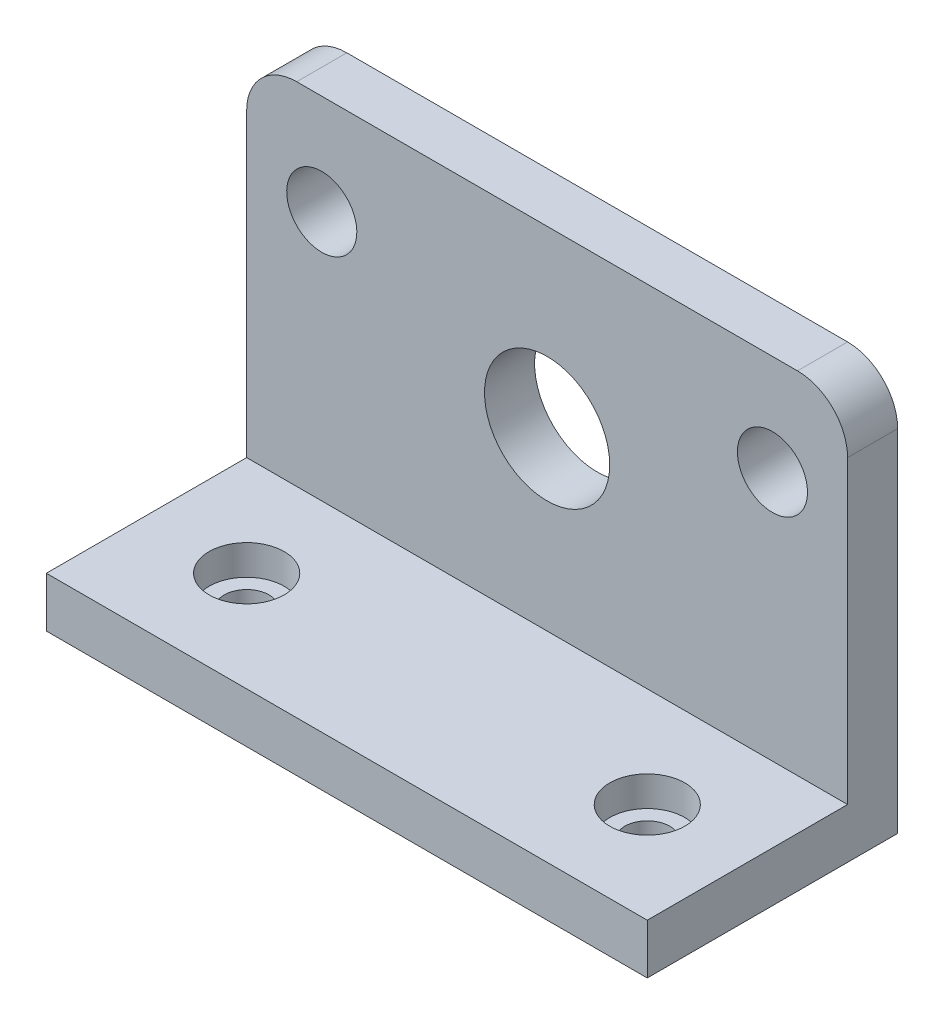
ISO-10303-21;
HEADER;
FILE_DESCRIPTION(('STEP AP214'),'2;1');
FILE_NAME('part.step','',(''),(''),'','','');
FILE_SCHEMA(('AUTOMOTIVE_DESIGN { 1 0 10303 214 1 1 1 1 }'));
ENDSEC;
DATA;
#1=APPLICATION_CONTEXT('core data for automotive mechanical design processes');
#2=APPLICATION_PROTOCOL_DEFINITION('international standard','automotive_design',2000,#1);
#3=PRODUCT_CONTEXT('',#1,'mechanical');
#4=PRODUCT('Part','Part','',(#3));
#5=PRODUCT_RELATED_PRODUCT_CATEGORY('part','',(#4));
#6=PRODUCT_DEFINITION_FORMATION('','',#4);
#7=PRODUCT_DEFINITION_CONTEXT('part definition',#1,'design');
#8=PRODUCT_DEFINITION('design','',#6,#7);
#9=PRODUCT_DEFINITION_SHAPE('','',#8);
#10=(LENGTH_UNIT() NAMED_UNIT(*) SI_UNIT(.MILLI.,.METRE.));
#11=(NAMED_UNIT(*) PLANE_ANGLE_UNIT() SI_UNIT($,.RADIAN.));
#12=(NAMED_UNIT(*) SI_UNIT($,.STERADIAN.) SOLID_ANGLE_UNIT());
#13=UNCERTAINTY_MEASURE_WITH_UNIT(LENGTH_MEASURE(1.E-05),#10,'distance_accuracy_value','');
#14=(GEOMETRIC_REPRESENTATION_CONTEXT(3) GLOBAL_UNCERTAINTY_ASSIGNED_CONTEXT((#13)) GLOBAL_UNIT_ASSIGNED_CONTEXT((#10,
#11,#12)) REPRESENTATION_CONTEXT('',''));
#15=CARTESIAN_POINT('',(0.,0.,0.));
#16=DIRECTION('',(0.,0.,1.));
#17=DIRECTION('',(1.,0.,0.));
#18=AXIS2_PLACEMENT_3D('',#15,#16,#17);
#19=CARTESIAN_POINT('',(60.,10.,0.));
#20=DIRECTION('',(0.,0.,-1.));
#21=DIRECTION('',(0.,1.,0.));
#22=AXIS2_PLACEMENT_3D('',#19,#20,#21);
#23=PLANE('',#22);
#24=DIRECTION('',(0.,-1.,0.));
#25=VECTOR('',#24,1.);
#26=CARTESIAN_POINT('',(-60.,10.,0.));
#27=LINE('',#26,#25);
#28=CARTESIAN_POINT('',(-60.,10.,0.));
#29=VERTEX_POINT('',#28);
#30=CARTESIAN_POINT('',(-60.,0.,0.));
#31=VERTEX_POINT('',#30);
#32=EDGE_CURVE('E129',#29,#31,#27,.T.);
#33=ORIENTED_EDGE('',*,*,#32,.T.);
#34=DIRECTION('',(-1.,0.,0.));
#35=VECTOR('',#34,1.);
#36=CARTESIAN_POINT('',(60.,0.,0.));
#37=LINE('',#36,#35);
#38=CARTESIAN_POINT('',(60.,0.,0.));
#39=VERTEX_POINT('',#38);
#40=EDGE_CURVE('E111',#39,#31,#37,.T.);
#41=ORIENTED_EDGE('',*,*,#40,.F.);
#42=DIRECTION('',(0.,-1.,0.));
#43=VECTOR('',#42,1.);
#44=CARTESIAN_POINT('',(60.,10.,0.));
#45=LINE('',#44,#43);
#46=CARTESIAN_POINT('',(60.,10.,0.));
#47=VERTEX_POINT('',#46);
#48=EDGE_CURVE('E117',#47,#39,#45,.T.);
#49=ORIENTED_EDGE('',*,*,#48,.F.);
#50=DIRECTION('',(-1.,0.,0.));
#51=VECTOR('',#50,1.);
#52=CARTESIAN_POINT('',(60.,10.,0.));
#53=LINE('',#52,#51);
#54=EDGE_CURVE('E171',#47,#29,#53,.T.);
#55=ORIENTED_EDGE('',*,*,#54,.T.);
#56=EDGE_LOOP('',(#33,#41,#49,#55));
#57=FACE_BOUND('',#56,.T.);
#58=ADVANCED_FACE('F38',(#57),#23,.F.);
#59=CARTESIAN_POINT('',(60.,0.,0.));
#60=DIRECTION('',(0.,1.,0.));
#61=DIRECTION('',(0.,0.,1.));
#62=AXIS2_PLACEMENT_3D('',#59,#60,#61);
#63=PLANE('',#62);
#64=CARTESIAN_POINT('',(-40.,0.,-20.));
#65=DIRECTION('',(0.,1.,0.));
#66=DIRECTION('',(0.,0.,1.));
#67=AXIS2_PLACEMENT_3D('',#64,#65,#66);
#68=CIRCLE('',#67,4.5);
#69=CARTESIAN_POINT('',(-40.,0.,-15.5));
#70=VERTEX_POINT('',#69);
#71=EDGE_CURVE('E263',#70,#70,#68,.T.);
#72=ORIENTED_EDGE('',*,*,#71,.T.);
#73=EDGE_LOOP('',(#72));
#74=FACE_BOUND('',#73,.T.);
#75=CARTESIAN_POINT('',(40.,0.,-20.));
#76=DIRECTION('',(0.,1.,0.));
#77=DIRECTION('',(0.,0.,1.));
#78=AXIS2_PLACEMENT_3D('',#75,#76,#77);
#79=CIRCLE('',#78,4.5);
#80=CARTESIAN_POINT('',(40.,0.,-15.5));
#81=VERTEX_POINT('',#80);
#82=EDGE_CURVE('E275',#81,#81,#79,.T.);
#83=ORIENTED_EDGE('',*,*,#82,.T.);
#84=EDGE_LOOP('',(#83));
#85=FACE_BOUND('',#84,.T.);
#86=DIRECTION('',(0.,0.,-1.));
#87=VECTOR('',#86,1.);
#88=CARTESIAN_POINT('',(-60.,0.,0.));
#89=LINE('',#88,#87);
#90=CARTESIAN_POINT('',(-60.,0.,-50.));
#91=VERTEX_POINT('',#90);
#92=EDGE_CURVE('E167',#31,#91,#89,.T.);
#93=ORIENTED_EDGE('',*,*,#92,.T.);
#94=DIRECTION('',(-1.,0.,0.));
#95=VECTOR('',#94,1.);
#96=CARTESIAN_POINT('',(60.,0.,-50.));
#97=LINE('',#96,#95);
#98=CARTESIAN_POINT('',(60.,0.,-50.));
#99=VERTEX_POINT('',#98);
#100=EDGE_CURVE('E114',#99,#91,#97,.T.);
#101=ORIENTED_EDGE('',*,*,#100,.F.);
#102=DIRECTION('',(0.,0.,-1.));
#103=VECTOR('',#102,1.);
#104=CARTESIAN_POINT('',(60.,0.,0.));
#105=LINE('',#104,#103);
#106=EDGE_CURVE('E107',#39,#99,#105,.T.);
#107=ORIENTED_EDGE('',*,*,#106,.F.);
#108=ORIENTED_EDGE('',*,*,#40,.T.);
#109=EDGE_LOOP('',(#93,#101,#107,#108));
#110=FACE_BOUND('',#109,.T.);
#111=ADVANCED_FACE('F109',(#74,#85,#110),#63,.F.);
#112=CARTESIAN_POINT('',(60.,0.,-50.));
#113=DIRECTION('',(0.,0.,1.));
#114=DIRECTION('',(1.,0.,0.));
#115=AXIS2_PLACEMENT_3D('',#112,#113,#114);
#116=PLANE('',#115);
#117=CARTESIAN_POINT('',(-45.,60.,-50.));
#118=DIRECTION('',(0.,0.,1.));
#119=DIRECTION('',(0.,-1.,0.));
#120=AXIS2_PLACEMENT_3D('',#117,#118,#119);
#121=CIRCLE('',#120,7.);
#122=CARTESIAN_POINT('',(-45.,53.,-50.));
#123=VERTEX_POINT('',#122);
#124=EDGE_CURVE('E281',#123,#123,#121,.T.);
#125=ORIENTED_EDGE('',*,*,#124,.T.);
#126=EDGE_LOOP('',(#125));
#127=FACE_BOUND('',#126,.T.);
#128=CARTESIAN_POINT('',(45.,60.,-50.));
#129=DIRECTION('',(0.,0.,1.));
#130=DIRECTION('',(0.,-1.,0.));
#131=AXIS2_PLACEMENT_3D('',#128,#129,#130);
#132=CIRCLE('',#131,7.);
#133=CARTESIAN_POINT('',(45.,53.,-50.));
#134=VERTEX_POINT('',#133);
#135=EDGE_CURVE('E287',#134,#134,#132,.T.);
#136=ORIENTED_EDGE('',*,*,#135,.T.);
#137=EDGE_LOOP('',(#136));
#138=FACE_BOUND('',#137,.T.);
#139=CARTESIAN_POINT('',(0.,45.,-50.));
#140=DIRECTION('',(0.,0.,1.));
#141=DIRECTION('',(1.,0.,0.));
#142=AXIS2_PLACEMENT_3D('',#139,#140,#141);
#143=CIRCLE('',#142,12.5);
#144=CARTESIAN_POINT('',(12.5,45.,-50.));
#145=VERTEX_POINT('',#144);
#146=EDGE_CURVE('E183',#145,#145,#143,.T.);
#147=ORIENTED_EDGE('',*,*,#146,.T.);
#148=EDGE_LOOP('',(#147));
#149=FACE_BOUND('',#148,.T.);
#150=DIRECTION('',(0.,1.,0.));
#151=VECTOR('',#150,1.);
#152=CARTESIAN_POINT('',(-60.,0.,-50.));
#153=LINE('',#152,#151);
#154=CARTESIAN_POINT('',(-60.,70.,-50.));
#155=VERTEX_POINT('',#154);
#156=EDGE_CURVE('E148',#91,#155,#153,.T.);
#157=ORIENTED_EDGE('',*,*,#156,.T.);
#158=CARTESIAN_POINT('',(-50.,70.,-50.));
#159=DIRECTION('',(0.,0.,1.));
#160=DIRECTION('',(1.,0.,0.));
#161=AXIS2_PLACEMENT_3D('',#158,#159,#160);
#162=CIRCLE('',#161,10.);
#163=CARTESIAN_POINT('',(-50.,80.,-50.));
#164=VERTEX_POINT('',#163);
#165=EDGE_CURVE('E46',#155,#164,#162,.F.);
#166=ORIENTED_EDGE('',*,*,#165,.T.);
#167=DIRECTION('',(-1.,0.,0.));
#168=VECTOR('',#167,1.);
#169=CARTESIAN_POINT('',(60.,80.,-50.));
#170=LINE('',#169,#168);
#171=CARTESIAN_POINT('',(50.,80.,-50.));
#172=VERTEX_POINT('',#171);
#173=EDGE_CURVE('E134',#172,#164,#170,.T.);
#174=ORIENTED_EDGE('',*,*,#173,.F.);
#175=CARTESIAN_POINT('',(50.,70.,-50.));
#176=DIRECTION('',(0.,0.,1.));
#177=DIRECTION('',(1.,0.,0.));
#178=AXIS2_PLACEMENT_3D('',#175,#176,#177);
#179=CIRCLE('',#178,10.);
#180=CARTESIAN_POINT('',(60.,70.,-50.));
#181=VERTEX_POINT('',#180);
#182=EDGE_CURVE('E53',#172,#181,#179,.F.);
#183=ORIENTED_EDGE('',*,*,#182,.T.);
#184=DIRECTION('',(0.,1.,0.));
#185=VECTOR('',#184,1.);
#186=CARTESIAN_POINT('',(60.,0.,-50.));
#187=LINE('',#186,#185);
#188=EDGE_CURVE('E116',#99,#181,#187,.T.);
#189=ORIENTED_EDGE('',*,*,#188,.F.);
#190=ORIENTED_EDGE('',*,*,#100,.T.);
#191=EDGE_LOOP('',(#157,#166,#174,#183,#189,#190));
#192=FACE_BOUND('',#191,.T.);
#193=ADVANCED_FACE('F147',(#127,#138,#149,#192),#116,.F.);
#194=CARTESIAN_POINT('',(60.,80.,-50.));
#195=DIRECTION('',(0.,-1.,0.));
#196=DIRECTION('',(0.,0.,-1.));
#197=AXIS2_PLACEMENT_3D('',#194,#195,#196);
#198=PLANE('',#197);
#199=ORIENTED_EDGE('',*,*,#173,.T.);
#200=DIRECTION('',(0.,0.,1.));
#201=VECTOR('',#200,1.);
#202=CARTESIAN_POINT('',(-50.,80.,-50.));
#203=LINE('',#202,#201);
#204=CARTESIAN_POINT('',(-50.,80.,-40.));
#205=VERTEX_POINT('',#204);
#206=EDGE_CURVE('E132',#164,#205,#203,.T.);
#207=ORIENTED_EDGE('',*,*,#206,.T.);
#208=DIRECTION('',(-1.,0.,0.));
#209=VECTOR('',#208,1.);
#210=CARTESIAN_POINT('',(60.,80.,-40.));
#211=LINE('',#210,#209);
#212=CARTESIAN_POINT('',(50.,80.,-40.));
#213=VERTEX_POINT('',#212);
#214=EDGE_CURVE('E156',#213,#205,#211,.T.);
#215=ORIENTED_EDGE('',*,*,#214,.F.);
#216=DIRECTION('',(0.,0.,1.));
#217=VECTOR('',#216,1.);
#218=CARTESIAN_POINT('',(50.,80.,-50.));
#219=LINE('',#218,#217);
#220=EDGE_CURVE('E130',#213,#172,#219,.F.);
#221=ORIENTED_EDGE('',*,*,#220,.T.);
#222=EDGE_LOOP('',(#199,#207,#215,#221));
#223=FACE_BOUND('',#222,.T.);
#224=ADVANCED_FACE('F152',(#223),#198,.F.);
#225=CARTESIAN_POINT('',(60.,80.,-40.));
#226=DIRECTION('',(0.,0.,-1.));
#227=DIRECTION('',(0.,1.,0.));
#228=AXIS2_PLACEMENT_3D('',#225,#226,#227);
#229=PLANE('',#228);
#230=CARTESIAN_POINT('',(-45.,60.,-40.));
#231=DIRECTION('',(0.,0.,1.));
#232=DIRECTION('',(0.,-1.,0.));
#233=AXIS2_PLACEMENT_3D('',#230,#231,#232);
#234=CIRCLE('',#233,7.);
#235=CARTESIAN_POINT('',(-45.,53.,-40.));
#236=VERTEX_POINT('',#235);
#237=EDGE_CURVE('E278',#236,#236,#234,.T.);
#238=ORIENTED_EDGE('',*,*,#237,.F.);
#239=EDGE_LOOP('',(#238));
#240=FACE_BOUND('',#239,.T.);
#241=CARTESIAN_POINT('',(45.,60.,-40.));
#242=DIRECTION('',(0.,0.,1.));
#243=DIRECTION('',(0.,-1.,0.));
#244=AXIS2_PLACEMENT_3D('',#241,#242,#243);
#245=CIRCLE('',#244,7.);
#246=CARTESIAN_POINT('',(45.,53.,-40.));
#247=VERTEX_POINT('',#246);
#248=EDGE_CURVE('E284',#247,#247,#245,.T.);
#249=ORIENTED_EDGE('',*,*,#248,.F.);
#250=EDGE_LOOP('',(#249));
#251=FACE_BOUND('',#250,.T.);
#252=CARTESIAN_POINT('',(0.,45.,-40.));
#253=DIRECTION('',(0.,0.,1.));
#254=DIRECTION('',(1.,0.,0.));
#255=AXIS2_PLACEMENT_3D('',#252,#253,#254);
#256=CIRCLE('',#255,12.5);
#257=CARTESIAN_POINT('',(12.5,45.,-40.));
#258=VERTEX_POINT('',#257);
#259=EDGE_CURVE('E290',#258,#258,#256,.T.);
#260=ORIENTED_EDGE('',*,*,#259,.F.);
#261=EDGE_LOOP('',(#260));
#262=FACE_BOUND('',#261,.T.);
#263=ORIENTED_EDGE('',*,*,#214,.T.);
#264=CARTESIAN_POINT('',(-50.,70.,-40.));
#265=DIRECTION('',(0.,0.,-1.));
#266=DIRECTION('',(0.,1.,0.));
#267=AXIS2_PLACEMENT_3D('',#264,#265,#266);
#268=CIRCLE('',#267,10.);
#269=CARTESIAN_POINT('',(-60.,70.,-40.));
#270=VERTEX_POINT('',#269);
#271=EDGE_CURVE('E142',#205,#270,#268,.F.);
#272=ORIENTED_EDGE('',*,*,#271,.T.);
#273=DIRECTION('',(0.,-1.,0.));
#274=VECTOR('',#273,1.);
#275=CARTESIAN_POINT('',(-60.,80.,-40.));
#276=LINE('',#275,#274);
#277=CARTESIAN_POINT('',(-60.,10.,-40.));
#278=VERTEX_POINT('',#277);
#279=EDGE_CURVE('E161',#270,#278,#276,.T.);
#280=ORIENTED_EDGE('',*,*,#279,.T.);
#281=DIRECTION('',(-1.,0.,0.));
#282=VECTOR('',#281,1.);
#283=CARTESIAN_POINT('',(60.,10.,-40.));
#284=LINE('',#283,#282);
#285=CARTESIAN_POINT('',(60.,10.,-40.));
#286=VERTEX_POINT('',#285);
#287=EDGE_CURVE('E173',#286,#278,#284,.T.);
#288=ORIENTED_EDGE('',*,*,#287,.F.);
#289=DIRECTION('',(0.,-1.,0.));
#290=VECTOR('',#289,1.);
#291=CARTESIAN_POINT('',(60.,80.,-40.));
#292=LINE('',#291,#290);
#293=CARTESIAN_POINT('',(60.,70.,-40.));
#294=VERTEX_POINT('',#293);
#295=EDGE_CURVE('E178',#294,#286,#292,.T.);
#296=ORIENTED_EDGE('',*,*,#295,.F.);
#297=CARTESIAN_POINT('',(50.,70.,-40.));
#298=DIRECTION('',(0.,0.,-1.));
#299=DIRECTION('',(0.,1.,0.));
#300=AXIS2_PLACEMENT_3D('',#297,#298,#299);
#301=CIRCLE('',#300,10.);
#302=EDGE_CURVE('E140',#294,#213,#301,.F.);
#303=ORIENTED_EDGE('',*,*,#302,.T.);
#304=EDGE_LOOP('',(#263,#272,#280,#288,#296,#303));
#305=FACE_BOUND('',#304,.T.);
#306=ADVANCED_FACE('F159',(#240,#251,#262,#305),#229,.F.);
#307=CARTESIAN_POINT('',(60.,10.,-40.));
#308=DIRECTION('',(0.,-1.,0.));
#309=DIRECTION('',(0.,0.,-1.));
#310=AXIS2_PLACEMENT_3D('',#307,#308,#309);
#311=PLANE('',#310);
#312=CARTESIAN_POINT('',(-40.,10.,-20.));
#313=DIRECTION('',(0.,1.,0.));
#314=DIRECTION('',(0.,0.,1.));
#315=AXIS2_PLACEMENT_3D('',#312,#313,#314);
#316=CIRCLE('',#315,7.5);
#317=CARTESIAN_POINT('',(-40.,10.,-12.5));
#318=VERTEX_POINT('',#317);
#319=EDGE_CURVE('E256',#318,#318,#316,.T.);
#320=ORIENTED_EDGE('',*,*,#319,.F.);
#321=EDGE_LOOP('',(#320));
#322=FACE_BOUND('',#321,.T.);
#323=CARTESIAN_POINT('',(40.,10.,-20.));
#324=DIRECTION('',(0.,1.,0.));
#325=DIRECTION('',(0.,0.,1.));
#326=AXIS2_PLACEMENT_3D('',#323,#324,#325);
#327=CIRCLE('',#326,7.5);
#328=CARTESIAN_POINT('',(40.,10.,-12.5));
#329=VERTEX_POINT('',#328);
#330=EDGE_CURVE('E266',#329,#329,#327,.T.);
#331=ORIENTED_EDGE('',*,*,#330,.F.);
#332=EDGE_LOOP('',(#331));
#333=FACE_BOUND('',#332,.T.);
#334=DIRECTION('',(0.,0.,1.));
#335=VECTOR('',#334,1.);
#336=CARTESIAN_POINT('',(-60.,10.,-40.));
#337=LINE('',#336,#335);
#338=EDGE_CURVE('E126',#278,#29,#337,.T.);
#339=ORIENTED_EDGE('',*,*,#338,.T.);
#340=ORIENTED_EDGE('',*,*,#54,.F.);
#341=DIRECTION('',(0.,0.,1.));
#342=VECTOR('',#341,1.);
#343=CARTESIAN_POINT('',(60.,10.,-40.));
#344=LINE('',#343,#342);
#345=EDGE_CURVE('E122',#286,#47,#344,.T.);
#346=ORIENTED_EDGE('',*,*,#345,.F.);
#347=ORIENTED_EDGE('',*,*,#287,.T.);
#348=EDGE_LOOP('',(#339,#340,#346,#347));
#349=FACE_BOUND('',#348,.T.);
#350=ADVANCED_FACE('F176',(#322,#333,#349),#311,.F.);
#351=CARTESIAN_POINT('',(60.,0.,0.));
#352=DIRECTION('',(1.,0.,0.));
#353=DIRECTION('',(0.,0.,-1.));
#354=AXIS2_PLACEMENT_3D('',#351,#352,#353);
#355=PLANE('',#354);
#356=ORIENTED_EDGE('',*,*,#188,.T.);
#357=DIRECTION('',(0.,0.,1.));
#358=VECTOR('',#357,1.);
#359=CARTESIAN_POINT('',(60.,70.,-40.));
#360=LINE('',#359,#358);
#361=EDGE_CURVE('E11',#181,#294,#360,.T.);
#362=ORIENTED_EDGE('',*,*,#361,.T.);
#363=ORIENTED_EDGE('',*,*,#295,.T.);
#364=ORIENTED_EDGE('',*,*,#345,.T.);
#365=ORIENTED_EDGE('',*,*,#48,.T.);
#366=ORIENTED_EDGE('',*,*,#106,.T.);
#367=EDGE_LOOP('',(#356,#362,#363,#364,#365,#366));
#368=FACE_BOUND('',#367,.T.);
#369=ADVANCED_FACE('F120',(#368),#355,.T.);
#370=CARTESIAN_POINT('',(-60.,0.,0.));
#371=DIRECTION('',(1.,0.,0.));
#372=DIRECTION('',(0.,0.,-1.));
#373=AXIS2_PLACEMENT_3D('',#370,#371,#372);
#374=PLANE('',#373);
#375=ORIENTED_EDGE('',*,*,#279,.F.);
#376=DIRECTION('',(0.,0.,1.));
#377=VECTOR('',#376,1.);
#378=CARTESIAN_POINT('',(-60.,70.,0.));
#379=LINE('',#378,#377);
#380=EDGE_CURVE('E61',#270,#155,#379,.F.);
#381=ORIENTED_EDGE('',*,*,#380,.T.);
#382=ORIENTED_EDGE('',*,*,#156,.F.);
#383=ORIENTED_EDGE('',*,*,#92,.F.);
#384=ORIENTED_EDGE('',*,*,#32,.F.);
#385=ORIENTED_EDGE('',*,*,#338,.F.);
#386=EDGE_LOOP('',(#375,#381,#382,#383,#384,#385));
#387=FACE_BOUND('',#386,.T.);
#388=ADVANCED_FACE('F164',(#387),#374,.F.);
#389=CARTESIAN_POINT('',(0.,45.,-50.));
#390=DIRECTION('',(0.,0.,1.));
#391=DIRECTION('',(1.,0.,0.));
#392=AXIS2_PLACEMENT_3D('',#389,#390,#391);
#393=CYLINDRICAL_SURFACE('',#392,12.5);
#394=ORIENTED_EDGE('',*,*,#146,.F.);
#395=EDGE_LOOP('',(#394));
#396=FACE_BOUND('',#395,.T.);
#397=ORIENTED_EDGE('',*,*,#259,.T.);
#398=EDGE_LOOP('',(#397));
#399=FACE_BOUND('',#398,.T.);
#400=ADVANCED_FACE('F212',(#396,#399),#393,.F.);
#401=CARTESIAN_POINT('',(45.,60.,-40.));
#402=DIRECTION('',(0.,0.,1.));
#403=DIRECTION('',(0.,-1.,0.));
#404=AXIS2_PLACEMENT_3D('',#401,#402,#403);
#405=CYLINDRICAL_SURFACE('',#404,7.);
#406=ORIENTED_EDGE('',*,*,#135,.F.);
#407=EDGE_LOOP('',(#406));
#408=FACE_BOUND('',#407,.T.);
#409=ORIENTED_EDGE('',*,*,#248,.T.);
#410=EDGE_LOOP('',(#409));
#411=FACE_BOUND('',#410,.T.);
#412=ADVANCED_FACE('F217',(#408,#411),#405,.F.);
#413=CARTESIAN_POINT('',(-45.,60.,-40.));
#414=DIRECTION('',(0.,0.,1.));
#415=DIRECTION('',(0.,-1.,0.));
#416=AXIS2_PLACEMENT_3D('',#413,#414,#415);
#417=CYLINDRICAL_SURFACE('',#416,7.);
#418=ORIENTED_EDGE('',*,*,#124,.F.);
#419=EDGE_LOOP('',(#418));
#420=FACE_BOUND('',#419,.T.);
#421=ORIENTED_EDGE('',*,*,#237,.T.);
#422=EDGE_LOOP('',(#421));
#423=FACE_BOUND('',#422,.T.);
#424=ADVANCED_FACE('F221',(#420,#423),#417,.F.);
#425=CARTESIAN_POINT('',(40.,10.,-20.));
#426=DIRECTION('',(0.,1.,0.));
#427=DIRECTION('',(0.,0.,1.));
#428=AXIS2_PLACEMENT_3D('',#425,#426,#427);
#429=CYLINDRICAL_SURFACE('',#428,4.5);
#430=ORIENTED_EDGE('',*,*,#82,.F.);
#431=EDGE_LOOP('',(#430));
#432=FACE_BOUND('',#431,.T.);
#433=CARTESIAN_POINT('',(40.,4.,-20.));
#434=DIRECTION('',(0.,1.,0.));
#435=DIRECTION('',(0.,0.,1.));
#436=AXIS2_PLACEMENT_3D('',#433,#434,#435);
#437=CIRCLE('',#436,4.5);
#438=CARTESIAN_POINT('',(40.,4.,-15.5));
#439=VERTEX_POINT('',#438);
#440=EDGE_CURVE('E272',#439,#439,#437,.T.);
#441=ORIENTED_EDGE('',*,*,#440,.T.);
#442=EDGE_LOOP('',(#441));
#443=FACE_BOUND('',#442,.T.);
#444=ADVANCED_FACE('F225',(#432,#443),#429,.F.);
#445=CARTESIAN_POINT('',(44.5,4.,-20.));
#446=DIRECTION('',(0.,-1.,0.));
#447=DIRECTION('',(0.,0.,-1.));
#448=AXIS2_PLACEMENT_3D('',#445,#446,#447);
#449=PLANE('',#448);
#450=ORIENTED_EDGE('',*,*,#440,.F.);
#451=EDGE_LOOP('',(#450));
#452=FACE_BOUND('',#451,.T.);
#453=CARTESIAN_POINT('',(40.,4.,-20.));
#454=DIRECTION('',(0.,1.,0.));
#455=DIRECTION('',(0.,0.,1.));
#456=AXIS2_PLACEMENT_3D('',#453,#454,#455);
#457=CIRCLE('',#456,7.5);
#458=CARTESIAN_POINT('',(40.,4.,-12.5));
#459=VERTEX_POINT('',#458);
#460=EDGE_CURVE('E269',#459,#459,#457,.T.);
#461=ORIENTED_EDGE('',*,*,#460,.T.);
#462=EDGE_LOOP('',(#461));
#463=FACE_BOUND('',#462,.T.);
#464=ADVANCED_FACE('F229',(#452,#463),#449,.F.);
#465=CARTESIAN_POINT('',(40.,10.,-20.));
#466=DIRECTION('',(0.,1.,0.));
#467=DIRECTION('',(0.,0.,1.));
#468=AXIS2_PLACEMENT_3D('',#465,#466,#467);
#469=CYLINDRICAL_SURFACE('',#468,7.5);
#470=ORIENTED_EDGE('',*,*,#460,.F.);
#471=EDGE_LOOP('',(#470));
#472=FACE_BOUND('',#471,.T.);
#473=ORIENTED_EDGE('',*,*,#330,.T.);
#474=EDGE_LOOP('',(#473));
#475=FACE_BOUND('',#474,.T.);
#476=ADVANCED_FACE('F233',(#472,#475),#469,.F.);
#477=CARTESIAN_POINT('',(-40.,10.,-20.));
#478=DIRECTION('',(0.,1.,0.));
#479=DIRECTION('',(0.,0.,1.));
#480=AXIS2_PLACEMENT_3D('',#477,#478,#479);
#481=CYLINDRICAL_SURFACE('',#480,4.5);
#482=ORIENTED_EDGE('',*,*,#71,.F.);
#483=EDGE_LOOP('',(#482));
#484=FACE_BOUND('',#483,.T.);
#485=CARTESIAN_POINT('',(-40.,4.,-20.));
#486=DIRECTION('',(0.,1.,0.));
#487=DIRECTION('',(0.,0.,1.));
#488=AXIS2_PLACEMENT_3D('',#485,#486,#487);
#489=CIRCLE('',#488,4.5);
#490=CARTESIAN_POINT('',(-40.,4.,-15.5));
#491=VERTEX_POINT('',#490);
#492=EDGE_CURVE('E258',#491,#491,#489,.T.);
#493=ORIENTED_EDGE('',*,*,#492,.T.);
#494=EDGE_LOOP('',(#493));
#495=FACE_BOUND('',#494,.T.);
#496=ADVANCED_FACE('F237',(#484,#495),#481,.F.);
#497=CARTESIAN_POINT('',(-35.5,4.,-20.));
#498=DIRECTION('',(0.,-1.,0.));
#499=DIRECTION('',(0.,0.,-1.));
#500=AXIS2_PLACEMENT_3D('',#497,#498,#499);
#501=PLANE('',#500);
#502=ORIENTED_EDGE('',*,*,#492,.F.);
#503=EDGE_LOOP('',(#502));
#504=FACE_BOUND('',#503,.T.);
#505=CARTESIAN_POINT('',(-40.,4.,-20.));
#506=DIRECTION('',(0.,1.,0.));
#507=DIRECTION('',(0.,0.,1.));
#508=AXIS2_PLACEMENT_3D('',#505,#506,#507);
#509=CIRCLE('',#508,7.5);
#510=CARTESIAN_POINT('',(-40.,4.,-12.5));
#511=VERTEX_POINT('',#510);
#512=EDGE_CURVE('E253',#511,#511,#509,.T.);
#513=ORIENTED_EDGE('',*,*,#512,.T.);
#514=EDGE_LOOP('',(#513));
#515=FACE_BOUND('',#514,.T.);
#516=ADVANCED_FACE('F241',(#504,#515),#501,.F.);
#517=CARTESIAN_POINT('',(-40.,10.,-20.));
#518=DIRECTION('',(0.,1.,0.));
#519=DIRECTION('',(0.,0.,1.));
#520=AXIS2_PLACEMENT_3D('',#517,#518,#519);
#521=CYLINDRICAL_SURFACE('',#520,7.5);
#522=ORIENTED_EDGE('',*,*,#512,.F.);
#523=EDGE_LOOP('',(#522));
#524=FACE_BOUND('',#523,.T.);
#525=ORIENTED_EDGE('',*,*,#319,.T.);
#526=EDGE_LOOP('',(#525));
#527=FACE_BOUND('',#526,.T.);
#528=ADVANCED_FACE('F190',(#524,#527),#521,.F.);
#529=CARTESIAN_POINT('',(-50.,70.,-50.));
#530=DIRECTION('',(0.,0.,1.));
#531=DIRECTION('',(1.,0.,0.));
#532=AXIS2_PLACEMENT_3D('',#529,#530,#531);
#533=CYLINDRICAL_SURFACE('',#532,10.);
#534=ORIENTED_EDGE('',*,*,#165,.F.);
#535=ORIENTED_EDGE('',*,*,#380,.F.);
#536=ORIENTED_EDGE('',*,*,#271,.F.);
#537=ORIENTED_EDGE('',*,*,#206,.F.);
#538=EDGE_LOOP('',(#534,#535,#536,#537));
#539=FACE_BOUND('',#538,.T.);
#540=ADVANCED_FACE('F157',(#539),#533,.T.);
#541=CARTESIAN_POINT('',(50.,70.,0.));
#542=DIRECTION('',(0.,0.,-1.));
#543=DIRECTION('',(-1.,0.,0.));
#544=AXIS2_PLACEMENT_3D('',#541,#542,#543);
#545=CYLINDRICAL_SURFACE('',#544,10.);
#546=ORIENTED_EDGE('',*,*,#182,.F.);
#547=ORIENTED_EDGE('',*,*,#220,.F.);
#548=ORIENTED_EDGE('',*,*,#302,.F.);
#549=ORIENTED_EDGE('',*,*,#361,.F.);
#550=EDGE_LOOP('',(#546,#547,#548,#549));
#551=FACE_BOUND('',#550,.T.);
#552=ADVANCED_FACE('F40',(#551),#545,.T.);
#553=CLOSED_SHELL('',(#58,#111,#193,#224,#306,#350,#369,#388,#400,#412,#424,#444,#464,#476,#496,
#516,#528,#540,#552));
#554=MANIFOLD_SOLID_BREP('B2',#553);
#555=ADVANCED_BREP_SHAPE_REPRESENTATION('',(#18,#554),#14);
#556=SHAPE_DEFINITION_REPRESENTATION(#9,#555);
ENDSEC;
END-ISO-10303-21;
